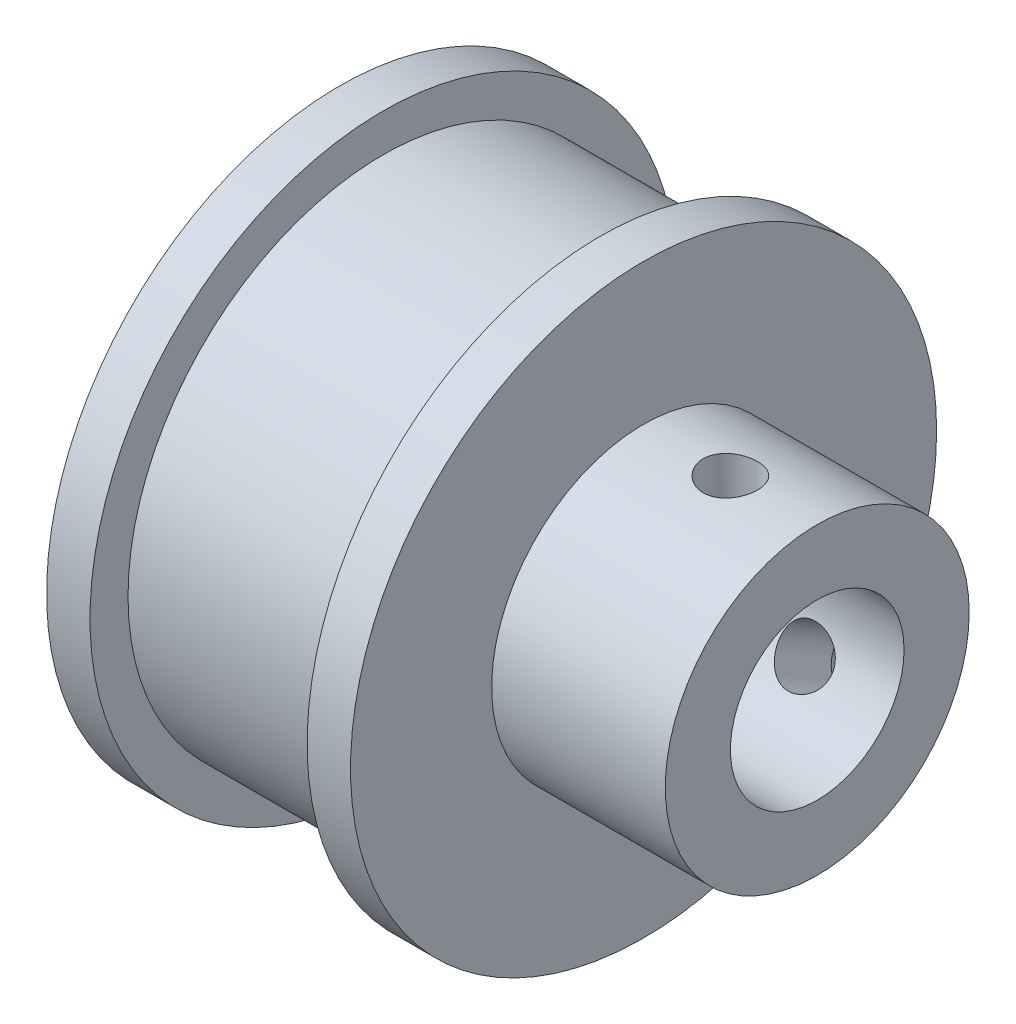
ISO-10303-21;
HEADER;
FILE_DESCRIPTION(('STEP AP214'),'2;1');
FILE_NAME('part.step','',(''),(''),'','','');
FILE_SCHEMA(('AUTOMOTIVE_DESIGN { 1 0 10303 214 1 1 1 1 }'));
ENDSEC;
DATA;
#1=APPLICATION_CONTEXT('core data for automotive mechanical design processes');
#2=APPLICATION_PROTOCOL_DEFINITION('international standard','automotive_design',2000,#1);
#3=PRODUCT_CONTEXT('',#1,'mechanical');
#4=PRODUCT('Part','Part','',(#3));
#5=PRODUCT_RELATED_PRODUCT_CATEGORY('part','',(#4));
#6=PRODUCT_DEFINITION_FORMATION('','',#4);
#7=PRODUCT_DEFINITION_CONTEXT('part definition',#1,'design');
#8=PRODUCT_DEFINITION('design','',#6,#7);
#9=PRODUCT_DEFINITION_SHAPE('','',#8);
#10=(LENGTH_UNIT() NAMED_UNIT(*) SI_UNIT(.MILLI.,.METRE.));
#11=(NAMED_UNIT(*) PLANE_ANGLE_UNIT() SI_UNIT($,.RADIAN.));
#12=(NAMED_UNIT(*) SI_UNIT($,.STERADIAN.) SOLID_ANGLE_UNIT());
#13=UNCERTAINTY_MEASURE_WITH_UNIT(LENGTH_MEASURE(1.E-05),#10,'distance_accuracy_value','');
#14=(GEOMETRIC_REPRESENTATION_CONTEXT(3) GLOBAL_UNCERTAINTY_ASSIGNED_CONTEXT((#13)) GLOBAL_UNIT_ASSIGNED_CONTEXT((#10,
#11,#12)) REPRESENTATION_CONTEXT('',''));
#15=CARTESIAN_POINT('',(0.,0.,0.));
#16=DIRECTION('',(0.,0.,1.));
#17=DIRECTION('',(1.,0.,0.));
#18=AXIS2_PLACEMENT_3D('',#15,#16,#17);
#19=CARTESIAN_POINT('',(14.,0.,0.));
#20=DIRECTION('',(1.,0.,0.));
#21=DIRECTION('',(0.,0.,-1.));
#22=AXIS2_PLACEMENT_3D('',#19,#20,#21);
#23=CYLINDRICAL_SURFACE('',#22,7.);
#24=CARTESIAN_POINT('',(18.,6.88748865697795,-1.25));
#25=CARTESIAN_POINT('',(18.0696098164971,6.88748996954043,-1.24999727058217));
#26=CARTESIAN_POINT('',(18.1392557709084,6.88855539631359,-1.24416565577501));
#27=CARTESIAN_POINT('',(18.2765881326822,6.89269731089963,-1.22100652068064));
#28=CARTESIAN_POINT('',(18.3442727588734,6.89577557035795,-1.20366887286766));
#29=CARTESIAN_POINT('',(18.4756753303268,6.90358364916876,-1.15804345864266));
#30=CARTESIAN_POINT('',(18.5393967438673,6.90831199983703,-1.12976542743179));
#31=CARTESIAN_POINT('',(18.6611855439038,6.91888575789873,-1.06308709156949));
#32=CARTESIAN_POINT('',(18.7192534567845,6.92473106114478,-1.024687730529));
#33=CARTESIAN_POINT('',(18.8287484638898,6.93695388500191,-0.938394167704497));
#34=CARTESIAN_POINT('',(18.8801024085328,6.94333619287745,-0.890407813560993));
#35=CARTESIAN_POINT('',(18.9740752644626,6.95587151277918,-0.786501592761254));
#36=CARTESIAN_POINT('',(19.0166936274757,6.96202451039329,-0.730581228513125));
#37=CARTESIAN_POINT('',(19.0922633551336,6.97345895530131,-0.611916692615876));
#38=CARTESIAN_POINT('',(19.1251461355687,6.97873410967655,-0.549128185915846));
#39=CARTESIAN_POINT('',(19.1798698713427,6.98776505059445,-0.418808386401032));
#40=CARTESIAN_POINT('',(19.2017116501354,6.99152095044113,-0.351277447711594));
#41=CARTESIAN_POINT('',(19.2335082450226,6.99705638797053,-0.214146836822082));
#42=CARTESIAN_POINT('',(19.2435862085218,6.99885638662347,-0.144576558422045));
#43=CARTESIAN_POINT('',(19.2519524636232,7.00034763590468,-0.00471086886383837));
#44=CARTESIAN_POINT('',(19.2502416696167,7.00003905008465,0.0655844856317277));
#45=CARTESIAN_POINT('',(19.2351741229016,6.99736398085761,0.20406149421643));
#46=CARTESIAN_POINT('',(19.2219499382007,6.99502092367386,0.272258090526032));
#47=CARTESIAN_POINT('',(19.1844402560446,6.98856637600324,0.405448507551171));
#48=CARTESIAN_POINT('',(19.1601543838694,6.98445482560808,0.470442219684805));
#49=CARTESIAN_POINT('',(19.1010820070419,6.97488577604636,0.595770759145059));
#50=CARTESIAN_POINT('',(19.0662417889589,6.96942141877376,0.656079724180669));
#51=CARTESIAN_POINT('',(18.9870891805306,6.95775231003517,0.770045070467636));
#52=CARTESIAN_POINT('',(18.9427759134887,6.95154749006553,0.823700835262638));
#53=CARTESIAN_POINT('',(18.8452024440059,6.93898404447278,0.923621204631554));
#54=CARTESIAN_POINT('',(18.7918263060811,6.93262448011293,0.969772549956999));
#55=CARTESIAN_POINT('',(18.6780303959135,6.92055128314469,1.052483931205));
#56=CARTESIAN_POINT('',(18.6176105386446,6.9148376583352,1.08904385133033));
#57=CARTESIAN_POINT('',(18.4913004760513,6.9047022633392,1.15156239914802));
#58=CARTESIAN_POINT('',(18.4254025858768,6.90028234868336,1.17750582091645));
#59=CARTESIAN_POINT('',(18.2900870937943,6.89326416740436,1.21792201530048));
#60=CARTESIAN_POINT('',(18.2206698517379,6.89066571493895,1.23239595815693));
#61=CARTESIAN_POINT('',(18.0813039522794,6.88762108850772,1.24929958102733));
#62=CARTESIAN_POINT('',(18.011375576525,6.88714593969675,1.25189141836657));
#63=CARTESIAN_POINT('',(17.8720848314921,6.88832434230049,1.24539080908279));
#64=CARTESIAN_POINT('',(17.802722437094,6.8899777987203,1.23629888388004));
#65=CARTESIAN_POINT('',(17.6670577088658,6.89520021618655,1.20682762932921));
#66=CARTESIAN_POINT('',(17.6007365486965,6.89875493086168,1.18653221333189));
#67=CARTESIAN_POINT('',(17.472436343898,6.90736720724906,1.13531866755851));
#68=CARTESIAN_POINT('',(17.4104575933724,6.91242487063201,1.10439981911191));
#69=CARTESIAN_POINT('',(17.2918839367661,6.92353975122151,1.03243967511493));
#70=CARTESIAN_POINT('',(17.2353525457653,6.92960692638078,0.991295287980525));
#71=CARTESIAN_POINT('',(17.1299378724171,6.94202871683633,0.900192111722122));
#72=CARTESIAN_POINT('',(17.0810552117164,6.948383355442,0.850232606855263));
#73=CARTESIAN_POINT('',(16.9917258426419,6.96075653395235,0.74219567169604));
#74=CARTESIAN_POINT('',(16.9513877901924,6.96677010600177,0.684027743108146));
#75=CARTESIAN_POINT('',(16.881056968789,6.97770176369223,0.56164648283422));
#76=CARTESIAN_POINT('',(16.8510638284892,6.98261988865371,0.497433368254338));
#77=CARTESIAN_POINT('',(16.8024397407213,6.99078504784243,0.365094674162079));
#78=CARTESIAN_POINT('',(16.7837538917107,6.99404014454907,0.296989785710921));
#79=CARTESIAN_POINT('',(16.75809885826,6.99854674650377,0.158545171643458));
#80=CARTESIAN_POINT('',(16.7511285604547,6.9997984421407,0.0882056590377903));
#81=CARTESIAN_POINT('',(16.7491382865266,7.00015390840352,-0.051666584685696));
#82=CARTESIAN_POINT('',(16.753953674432,6.99928727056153,-0.121196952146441));
#83=CARTESIAN_POINT('',(16.7750394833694,6.99556445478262,-0.258441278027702));
#84=CARTESIAN_POINT('',(16.791309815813,6.99270829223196,-0.326155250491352));
#85=CARTESIAN_POINT('',(16.8347769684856,6.98532676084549,-0.457768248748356));
#86=CARTESIAN_POINT('',(16.8619578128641,6.98080383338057,-0.521672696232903));
#87=CARTESIAN_POINT('',(16.926455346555,6.97058019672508,-0.644038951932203));
#88=CARTESIAN_POINT('',(16.9637726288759,6.96487941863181,-0.702500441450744));
#89=CARTESIAN_POINT('',(17.0480579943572,6.952836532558,-0.813145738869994));
#90=CARTESIAN_POINT('',(17.0951457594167,6.94648702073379,-0.865237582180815));
#91=CARTESIAN_POINT('',(17.1973856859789,6.9339109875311,-0.960837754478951));
#92=CARTESIAN_POINT('',(17.2525397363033,6.92768449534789,-1.0043440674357));
#93=CARTESIAN_POINT('',(17.3698905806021,6.91600352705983,-1.08187311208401));
#94=CARTESIAN_POINT('',(17.4321418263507,6.9105558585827,-1.1158144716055));
#95=CARTESIAN_POINT('',(17.5615375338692,6.90113054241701,-1.17270443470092));
#96=CARTESIAN_POINT('',(17.6286771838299,6.89715147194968,-1.19566368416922));
#97=CARTESIAN_POINT('',(17.7467033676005,6.89196709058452,-1.22512899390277));
#98=CARTESIAN_POINT('',(17.7968879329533,6.89029736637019,-1.23444009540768));
#99=CARTESIAN_POINT('',(17.8980418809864,6.88805768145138,-1.24687652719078));
#100=CARTESIAN_POINT('',(17.9490112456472,6.88748769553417,-1.25000199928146));
#101=CARTESIAN_POINT('',(18.,6.88748865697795,-1.25));
#102=B_SPLINE_CURVE_WITH_KNOTS('',3,(#24,#25,#26,#27,#28,#29,#30,#31,#32,#33,#34,#35,#36,#37,
#38,#39,#40,#41,#42,#43,#44,#45,#46,#47,#48,#49,#50,#51,#52,#53,#54,#55,#56,#57,#58,#59,#60,#61,
#62,#63,#64,#65,#66,#67,#68,#69,#70,#71,#72,#73,#74,#75,#76,#77,#78,#79,#80,#81,#82,#83,#84,#85,
#86,#87,#88,#89,#90,#91,#92,#93,#94,#95,#96,#97,#98,#99,#100,#101),.UNSPECIFIED.,.T.,.F.,(4,2,2,
2,2,2,2,2,2,2,2,2,2,2,2,2,2,2,2,2,2,2,2,2,2,2,2,2,2,2,2,2,2,2,2,2,2,2,4),(0.,0.208642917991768,
0.41746972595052,0.626111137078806,0.834733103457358,1.04546625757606,1.25621263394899,
1.46841013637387,1.68059181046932,1.89053179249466,2.10045549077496,2.30799357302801,
2.51553868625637,2.72415831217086,2.93279725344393,3.14433992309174,3.35588514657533,
3.56773231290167,3.77955786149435,3.98848380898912,4.19740043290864,4.40477310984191,
4.61215981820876,4.82172878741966,5.03131478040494,5.24342420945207,5.45552602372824,
5.66658955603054,5.87763302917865,6.08574527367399,6.29385590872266,6.50166292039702,
6.70948209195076,6.9200155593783,7.1305984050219,7.34292209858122,7.55503954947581,
7.70787268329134,7.86070231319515),.UNSPECIFIED.);
#103=CARTESIAN_POINT('',(18.,6.88748865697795,-1.25));
#104=VERTEX_POINT('',#103);
#105=EDGE_CURVE('E66',#104,#104,#102,.T.);
#106=ORIENTED_EDGE('',*,*,#105,.T.);
#107=EDGE_LOOP('',(#106));
#108=FACE_BOUND('',#107,.T.);
#109=CARTESIAN_POINT('',(14.,0.,0.));
#110=DIRECTION('',(1.,0.,0.));
#111=DIRECTION('',(0.,0.,-1.));
#112=AXIS2_PLACEMENT_3D('',#109,#110,#111);
#113=CIRCLE('',#112,7.);
#114=CARTESIAN_POINT('',(14.,0.,-7.));
#115=VERTEX_POINT('',#114);
#116=EDGE_CURVE('E60',#115,#115,#113,.T.);
#117=ORIENTED_EDGE('',*,*,#116,.T.);
#118=EDGE_LOOP('',(#117));
#119=FACE_BOUND('',#118,.T.);
#120=CARTESIAN_POINT('',(22.,0.,0.));
#121=DIRECTION('',(1.,0.,0.));
#122=DIRECTION('',(0.,0.,-1.));
#123=AXIS2_PLACEMENT_3D('',#120,#121,#122);
#124=CIRCLE('',#123,7.);
#125=CARTESIAN_POINT('',(22.,0.,-7.));
#126=VERTEX_POINT('',#125);
#127=EDGE_CURVE('E124',#126,#126,#124,.T.);
#128=ORIENTED_EDGE('',*,*,#127,.F.);
#129=EDGE_LOOP('',(#128));
#130=FACE_BOUND('',#129,.T.);
#131=CARTESIAN_POINT('',(18.,-4.52627608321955,-5.33974014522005));
#132=CARTESIAN_POINT('',(18.0696098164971,-4.52627437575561,-5.33974264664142));
#133=CARTESIAN_POINT('',(18.1392557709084,-4.5217567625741,-5.34358114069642));
#134=CARTESIAN_POINT('',(18.2765881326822,-4.50377132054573,-5.35874771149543));
#135=CARTESIAN_POINT('',(18.3442727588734,-4.49029560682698,-5.37008238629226));
#136=CARTESIAN_POINT('',(18.4756753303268,-4.45468687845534,-5.39965708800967));
#137=CARTESIAN_POINT('',(18.5393967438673,-4.43256156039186,-5.41789097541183));
#138=CARTESIAN_POINT('',(18.6611855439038,-4.38010330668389,-5.46038728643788));
#139=CARTESIAN_POINT('',(18.7192534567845,-4.34977113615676,-5.48464914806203));
#140=CARTESIAN_POINT('',(18.8287484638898,-4.28115013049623,-5.53838120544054));
#141=CARTESIAN_POINT('',(18.8801024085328,-4.24278388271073,-5.56790162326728));
#142=CARTESIAN_POINT('',(18.9740752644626,-4.15906611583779,-5.63071063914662));
#143=CARTESIAN_POINT('',(19.0166936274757,-4.11371415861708,-5.66399947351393));
#144=CARTESIAN_POINT('',(19.0922633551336,-4.01666487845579,-5.73323426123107));
#145=CARTESIAN_POINT('',(19.1251461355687,-3.96492601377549,-5.76919693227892));
#146=CARTESIAN_POINT('',(19.1798698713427,-3.85658122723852,-5.84217785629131));
#147=CARTESIAN_POINT('',(19.2017116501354,-3.79997566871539,-5.87919603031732));
#148=CARTESIAN_POINT('',(19.2335082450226,-3.6839847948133,-5.95255516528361));
#149=CARTESIAN_POINT('',(19.2435862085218,-3.62463516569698,-5.98889914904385));
#150=CARTESIAN_POINT('',(19.2519524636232,-3.50425355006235,-6.06012345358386));
#151=CARTESIAN_POINT('',(19.2502416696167,-3.44322169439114,-6.09500388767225));
#152=CARTESIAN_POINT('',(19.2351741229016,-3.3219595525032,-6.1619257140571));
#153=CARTESIAN_POINT('',(19.2219499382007,-3.26172803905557,-6.19399486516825));
#154=CARTESIAN_POINT('',(19.1844402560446,-3.14315448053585,-6.25500027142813));
#155=CARTESIAN_POINT('',(19.1601543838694,-3.08481249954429,-6.2839364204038));
#156=CARTESIAN_POINT('',(19.1010820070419,-2.97149027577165,-6.3383136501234));
#157=CARTESIAN_POINT('',(19.0662417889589,-2.91652900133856,-6.36373586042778));
#158=CARTESIAN_POINT('',(18.9870891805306,-2.81199756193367,-6.41061278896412));
#159=CARTESIAN_POINT('',(18.9427759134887,-2.76242789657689,-6.43206713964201));
#160=CARTESIAN_POINT('',(18.8452024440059,-2.66961259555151,-6.47114706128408));
#161=CARTESIAN_POINT('',(18.7918263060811,-2.62646457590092,-6.48871518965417));
#162=CARTESIAN_POINT('',(18.6780303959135,-2.54879782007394,-6.51961518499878));
#163=CARTESIAN_POINT('',(18.6176105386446,-2.51427918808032,-6.53294700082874));
#164=CARTESIAN_POINT('',(18.4913004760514,-2.45506883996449,-6.55542876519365));
#165=CARTESIAN_POINT('',(18.4254025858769,-2.43039122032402,-6.56457271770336));
#166=CARTESIAN_POINT('',(18.2900870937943,-2.39188067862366,-6.5787028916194));
#167=CARTESIAN_POINT('',(18.2206698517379,-2.37804665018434,-6.58368953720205));
#168=CARTESIAN_POINT('',(18.0813039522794,-2.36188537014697,-6.58950462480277));
#169=CARTESIAN_POINT('',(18.011375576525,-2.35940319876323,-6.59038905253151));
#170=CARTESIAN_POINT('',(17.8720848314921,-2.36562209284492,-6.58815927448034));
#171=CARTESIAN_POINT('',(17.802722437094,-2.37432265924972,-6.58504524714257));
#172=CARTESIAN_POINT('',(17.6670577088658,-2.40245672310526,-6.5748323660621));
#173=CARTESIAN_POINT('',(17.6007365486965,-2.42181042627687,-6.56776313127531));
#174=CARTESIAN_POINT('',(17.472436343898,-2.47046879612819,-6.5496148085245));
#175=CARTESIAN_POINT('',(17.4104575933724,-2.49977413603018,-6.53853544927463));
#176=CARTESIAN_POINT('',(17.2918839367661,-2.56765088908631,-6.51218114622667));
#177=CARTESIAN_POINT('',(17.2353525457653,-2.60631656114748,-6.49686328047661));
#178=CARTESIAN_POINT('',(17.1299378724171,-2.69142512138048,-6.4620692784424));
#179=CARTESIAN_POINT('',(17.0810552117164,-2.7378686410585,-6.44259280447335));
#180=CARTESIAN_POINT('',(16.9917258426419,-2.83761796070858,-6.39928982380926));
#181=CARTESIAN_POINT('',(16.9513877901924,-2.89099965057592,-6.3754137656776));
#182=CARTESIAN_POINT('',(16.881056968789,-3.00245075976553,-6.32369022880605));
#183=CARTESIAN_POINT('',(16.8510638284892,-3.06052001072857,-6.29584289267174));
#184=CARTESIAN_POINT('',(16.8024397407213,-3.17921126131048,-6.23674478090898));
#185=CARTESIAN_POINT('',(16.7837538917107,-3.23981937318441,-6.20551133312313));
#186=CARTESIAN_POINT('',(16.75809885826,-3.36196922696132,-6.14019185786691));
#187=CARTESIAN_POINT('',(16.7511285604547,-3.4235108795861,-6.10610610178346));
#188=CARTESIAN_POINT('',(16.7491382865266,-3.54482152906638,-6.03647782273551));
#189=CARTESIAN_POINT('',(16.753953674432,-3.60460327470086,-6.0009621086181));
#190=CARTESIAN_POINT('',(16.7750394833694,-3.72159893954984,-5.92911589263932));
#191=CARTESIAN_POINT('',(16.791309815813,-3.77881287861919,-5.89278539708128));
#192=CARTESIAN_POINT('',(16.8347769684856,-3.88910231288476,-5.82058630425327));
#193=CARTESIAN_POINT('',(16.8619578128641,-3.94218372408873,-5.78471711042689));
#194=CARTESIAN_POINT('',(16.926455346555,-4.04304419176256,-5.71468005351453));
#195=CARTESIAN_POINT('',(16.9637726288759,-4.09082293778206,-5.68051229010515));
#196=CARTESIAN_POINT('',(17.0480579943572,-4.18062313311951,-5.61476019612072));
#197=CARTESIAN_POINT('',(17.0951457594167,-4.22256123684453,-5.58321543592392));
#198=CARTESIAN_POINT('',(17.1973856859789,-4.29906539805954,-5.52452418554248));
#199=CARTESIAN_POINT('',(17.2525397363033,-4.33362972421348,-5.49737872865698));
#200=CARTESIAN_POINT('',(17.3698905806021,-4.39493136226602,-5.44849819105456));
#201=CARTESIAN_POINT('',(17.4321418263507,-4.42160160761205,-5.42680969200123));
#202=CARTESIAN_POINT('',(17.5615375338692,-4.4661571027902,-5.39020214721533));
#203=CARTESIAN_POINT('',(17.6286771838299,-4.4840508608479,-5.37527654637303));
#204=CARTESIAN_POINT('',(17.7467033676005,-4.50697637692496,-5.35605408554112));
#205=CARTESIAN_POINT('',(17.7968879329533,-4.51420516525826,-5.34995251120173));
#206=CARTESIAN_POINT('',(17.8980418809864,-4.52385558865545,-5.34179467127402));
#207=CARTESIAN_POINT('',(17.9490112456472,-4.52627733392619,-5.33973831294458));
#208=CARTESIAN_POINT('',(18.,-4.52627608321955,-5.33974014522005));
#209=B_SPLINE_CURVE_WITH_KNOTS('',3,(#131,#132,#133,#134,#135,#136,#137,#138,#139,#140,#141,
#142,#143,#144,#145,#146,#147,#148,#149,#150,#151,#152,#153,#154,#155,#156,#157,#158,#159,#160,
#161,#162,#163,#164,#165,#166,#167,#168,#169,#170,#171,#172,#173,#174,#175,#176,#177,#178,#179,
#180,#181,#182,#183,#184,#185,#186,#187,#188,#189,#190,#191,#192,#193,#194,#195,#196,#197,#198,
#199,#200,#201,#202,#203,#204,#205,#206,#207,#208),.UNSPECIFIED.,.T.,.F.,(4,2,2,2,2,2,2,2,2,2,2,
2,2,2,2,2,2,2,2,2,2,2,2,2,2,2,2,2,2,2,2,2,2,2,2,2,2,2,4),(0.,0.208642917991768,0.41746972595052,
0.626111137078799,0.834733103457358,1.04546625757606,1.25621263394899,1.46841013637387,
1.68059181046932,1.89053179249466,2.10045549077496,2.30799357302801,2.51553868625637,
2.72415831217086,2.93279725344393,3.14433992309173,3.35588514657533,3.56773231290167,
3.77955786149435,3.98848380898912,4.19740043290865,4.40477310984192,4.61215981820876,
4.82172878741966,5.03131478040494,5.24342420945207,5.45552602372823,5.66658955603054,
5.87763302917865,6.08574527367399,6.29385590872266,6.50166292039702,6.70948209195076,
6.9200155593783,7.1305984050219,7.34292209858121,7.55503954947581,7.70787268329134,
7.86070231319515),.UNSPECIFIED.);
#210=CARTESIAN_POINT('',(18.,-4.52627608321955,-5.33974014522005));
#211=VERTEX_POINT('',#210);
#212=EDGE_CURVE('E67',#211,#211,#209,.T.);
#213=ORIENTED_EDGE('',*,*,#212,.T.);
#214=EDGE_LOOP('',(#213));
#215=FACE_BOUND('',#214,.T.);
#216=ADVANCED_FACE('F32',(#108,#119,#130,#215),#23,.T.);
#217=CARTESIAN_POINT('',(0.,0.,0.));
#218=DIRECTION('',(1.,0.,0.));
#219=DIRECTION('',(0.,0.,-1.));
#220=AXIS2_PLACEMENT_3D('',#217,#218,#219);
#221=CYLINDRICAL_SURFACE('',#220,4.);
#222=CARTESIAN_POINT('',(18.,3.79967103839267,-1.25));
#223=CARTESIAN_POINT('',(18.0683470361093,3.79967145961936,-1.24999953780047));
#224=CARTESIAN_POINT('',(18.1366987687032,3.80153531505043,-1.24437538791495));
#225=CARTESIAN_POINT('',(18.2713941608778,3.80875638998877,-1.22209175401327));
#226=CARTESIAN_POINT('',(18.3377372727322,3.81411455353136,-1.20542928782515));
#227=CARTESIAN_POINT('',(18.466444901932,3.8276593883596,-1.16169788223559));
#228=CARTESIAN_POINT('',(18.5288162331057,3.83584105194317,-1.13464735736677));
#229=CARTESIAN_POINT('',(18.648152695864,3.85410406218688,-1.07096914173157));
#230=CARTESIAN_POINT('',(18.7051168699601,3.8641857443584,-1.03433975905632));
#231=CARTESIAN_POINT('',(18.8139788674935,3.8855012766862,-0.951196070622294));
#232=CARTESIAN_POINT('',(18.865663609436,3.8967612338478,-0.904409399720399));
#233=CARTESIAN_POINT('',(18.9605960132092,3.91894245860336,-0.802862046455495));
#234=CARTESIAN_POINT('',(19.0038424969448,3.92986367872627,-0.748100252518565));
#235=CARTESIAN_POINT('',(19.0816110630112,3.95043553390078,-0.630625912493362));
#236=CARTESIAN_POINT('',(19.1159137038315,3.9600518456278,-0.567761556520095));
#237=CARTESIAN_POINT('',(19.1733760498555,3.97662551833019,-0.436804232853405));
#238=CARTESIAN_POINT('',(19.1965383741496,3.98358350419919,-0.368712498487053));
#239=CARTESIAN_POINT('',(19.2303511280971,3.99387175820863,-0.231464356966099));
#240=CARTESIAN_POINT('',(19.2413657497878,3.99730738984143,-0.162405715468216));
#241=CARTESIAN_POINT('',(19.2517243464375,4.00053595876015,-0.0233408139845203));
#242=CARTESIAN_POINT('',(19.2510709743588,4.00032972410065,0.0466652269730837));
#243=CARTESIAN_POINT('',(19.2383517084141,3.99637116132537,0.183074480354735));
#244=CARTESIAN_POINT('',(19.226680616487,3.99274150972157,0.249518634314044));
#245=CARTESIAN_POINT('',(19.192905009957,3.98249482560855,0.37945306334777));
#246=CARTESIAN_POINT('',(19.1707998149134,3.97587759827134,0.442943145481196));
#247=CARTESIAN_POINT('',(19.1165298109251,3.96023459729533,0.566078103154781));
#248=CARTESIAN_POINT('',(19.084245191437,3.95118033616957,0.62566640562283));
#249=CARTESIAN_POINT('',(19.0106289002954,3.93161722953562,0.738702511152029));
#250=CARTESIAN_POINT('',(18.9692949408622,3.92110801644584,0.792148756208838));
#251=CARTESIAN_POINT('',(18.8767263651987,3.89923670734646,0.893737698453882));
#252=CARTESIAN_POINT('',(18.8251509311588,3.88785731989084,0.941566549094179));
#253=CARTESIAN_POINT('',(18.7146048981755,3.86590615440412,1.02798974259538));
#254=CARTESIAN_POINT('',(18.655633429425,3.85533447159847,1.06658299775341));
#255=CARTESIAN_POINT('',(18.5310825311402,3.83610846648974,1.13380465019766));
#256=CARTESIAN_POINT('',(18.4654365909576,3.82747690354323,1.16231680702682));
#257=CARTESIAN_POINT('',(18.3299405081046,3.81337545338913,1.20778345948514));
#258=CARTESIAN_POINT('',(18.2600918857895,3.80790443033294,1.22474210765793));
#259=CARTESIAN_POINT('',(18.1211800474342,3.80099563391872,1.24601485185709));
#260=CARTESIAN_POINT('',(18.0521980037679,3.79940466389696,1.25080954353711));
#261=CARTESIAN_POINT('',(17.9144102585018,3.80001077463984,1.24896744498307));
#262=CARTESIAN_POINT('',(17.8456045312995,3.80220727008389,1.24233242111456));
#263=CARTESIAN_POINT('',(17.7121917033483,3.80998957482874,1.21824873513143));
#264=CARTESIAN_POINT('',(17.647520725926,3.81547554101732,1.20111831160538));
#265=CARTESIAN_POINT('',(17.521978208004,3.82911287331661,1.15690373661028));
#266=CARTESIAN_POINT('',(17.4611072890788,3.83726467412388,1.12981796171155));
#267=CARTESIAN_POINT('',(17.3429608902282,3.85560539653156,1.06557510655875));
#268=CARTESIAN_POINT('',(17.2858385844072,3.86584603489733,1.02815147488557));
#269=CARTESIAN_POINT('',(17.1785096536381,3.88710348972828,0.944606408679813));
#270=CARTESIAN_POINT('',(17.1283048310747,3.89812050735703,0.898482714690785));
#271=CARTESIAN_POINT('',(17.0340896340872,3.92024187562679,0.796572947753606));
#272=CARTESIAN_POINT('',(16.9904222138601,3.93133092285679,0.740465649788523));
#273=CARTESIAN_POINT('',(16.9131089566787,3.95189059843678,0.6214515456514));
#274=CARTESIAN_POINT('',(16.879462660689,3.96136130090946,0.558545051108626));
#275=CARTESIAN_POINT('',(16.8234694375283,3.97756311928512,0.428105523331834));
#276=CARTESIAN_POINT('',(16.8010407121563,3.984313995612,0.360610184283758));
#277=CARTESIAN_POINT('',(16.7679274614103,3.99440242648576,0.222557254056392));
#278=CARTESIAN_POINT('',(16.7572392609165,3.99774104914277,0.152000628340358));
#279=CARTESIAN_POINT('',(16.7482089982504,4.00055803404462,0.0129849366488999));
#280=CARTESIAN_POINT('',(16.7493715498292,4.0001912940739,-0.0554391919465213));
#281=CARTESIAN_POINT('',(16.7628118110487,3.99600978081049,-0.191073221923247));
#282=CARTESIAN_POINT('',(16.7750887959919,3.99219523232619,-0.258283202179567));
#283=CARTESIAN_POINT('',(16.8100940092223,3.98159570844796,-0.38875511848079));
#284=CARTESIAN_POINT('',(16.8326896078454,3.97484847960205,-0.452055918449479));
#285=CARTESIAN_POINT('',(16.8875708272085,3.9590794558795,-0.57399842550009));
#286=CARTESIAN_POINT('',(16.9198581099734,3.95005727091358,-0.632639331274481));
#287=CARTESIAN_POINT('',(16.9944727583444,3.93029896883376,-0.74576169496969));
#288=CARTESIAN_POINT('',(17.037103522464,3.91951509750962,-0.800034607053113));
#289=CARTESIAN_POINT('',(17.1306598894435,3.89758736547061,-0.90082079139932));
#290=CARTESIAN_POINT('',(17.1815879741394,3.88644339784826,-0.94733173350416));
#291=CARTESIAN_POINT('',(17.2923157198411,3.86461892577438,-1.03282865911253));
#292=CARTESIAN_POINT('',(17.3523534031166,3.85396600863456,-1.07151427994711));
#293=CARTESIAN_POINT('',(17.4783981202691,3.83480125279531,-1.13820470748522));
#294=CARTESIAN_POINT('',(17.5444027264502,3.82628854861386,-1.16621383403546));
#295=CARTESIAN_POINT('',(17.6747226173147,3.81306560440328,-1.20871180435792));
#296=CARTESIAN_POINT('',(17.7387025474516,3.80809315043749,-1.22414939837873));
#297=CARTESIAN_POINT('',(17.8684538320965,3.80139606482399,-1.244792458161));
#298=CARTESIAN_POINT('',(17.9342247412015,3.79967063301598,-1.25000044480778));
#299=CARTESIAN_POINT('',(18.,3.79967103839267,-1.25));
#300=B_SPLINE_CURVE_WITH_KNOTS('',3,(#222,#223,#224,#225,#226,#227,#228,#229,#230,#231,#232,
#233,#234,#235,#236,#237,#238,#239,#240,#241,#242,#243,#244,#245,#246,#247,#248,#249,#250,#251,
#252,#253,#254,#255,#256,#257,#258,#259,#260,#261,#262,#263,#264,#265,#266,#267,#268,#269,#270,
#271,#272,#273,#274,#275,#276,#277,#278,#279,#280,#281,#282,#283,#284,#285,#286,#287,#288,#289,
#290,#291,#292,#293,#294,#295,#296,#297,#298,#299),.UNSPECIFIED.,.T.,.F.,(4,2,2,2,2,2,2,2,2,2,2,
2,2,2,2,2,2,2,2,2,2,2,2,2,2,2,2,2,2,2,2,2,2,2,2,2,2,2,4),(0.,0.20479813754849,0.409651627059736,
0.614143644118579,0.818671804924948,1.02957080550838,1.24049922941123,1.45619821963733,
1.67184647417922,1.88083722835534,2.08978046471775,2.29150982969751,2.49325235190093,
2.69746404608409,2.90172742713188,3.11450338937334,3.32730439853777,3.54248470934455,
3.75758763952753,3.96404933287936,4.1704791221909,4.37093972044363,4.5714330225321,
4.77767613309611,4.98397288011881,5.19881937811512,5.41365603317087,5.62690239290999,
5.84008198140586,6.04438802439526,6.24868074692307,6.4504184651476,6.65219079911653,
6.86080693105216,7.06948557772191,7.28507795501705,7.50058300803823,7.69772354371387,
7.8948154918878),.UNSPECIFIED.);
#301=CARTESIAN_POINT('',(18.,3.79967103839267,-1.25));
#302=VERTEX_POINT('',#301);
#303=EDGE_CURVE('E61',#302,#302,#300,.T.);
#304=ORIENTED_EDGE('',*,*,#303,.F.);
#305=EDGE_LOOP('',(#304));
#306=FACE_BOUND('',#305,.T.);
#307=CARTESIAN_POINT('',(0.,0.,0.));
#308=DIRECTION('',(1.,0.,0.));
#309=DIRECTION('',(0.,0.,-1.));
#310=AXIS2_PLACEMENT_3D('',#307,#308,#309);
#311=CIRCLE('',#310,4.);
#312=CARTESIAN_POINT('',(0.,0.,-4.));
#313=VERTEX_POINT('',#312);
#314=EDGE_CURVE('E88',#313,#313,#311,.T.);
#315=ORIENTED_EDGE('',*,*,#314,.F.);
#316=EDGE_LOOP('',(#315));
#317=FACE_BOUND('',#316,.T.);
#318=CARTESIAN_POINT('',(22.,0.,0.));
#319=DIRECTION('',(1.,0.,0.));
#320=DIRECTION('',(0.,0.,-1.));
#321=AXIS2_PLACEMENT_3D('',#318,#319,#320);
#322=CIRCLE('',#321,4.);
#323=CARTESIAN_POINT('',(22.,0.,-4.));
#324=VERTEX_POINT('',#323);
#325=EDGE_CURVE('E85',#324,#324,#322,.T.);
#326=ORIENTED_EDGE('',*,*,#325,.T.);
#327=EDGE_LOOP('',(#326));
#328=FACE_BOUND('',#327,.T.);
#329=CARTESIAN_POINT('',(18.,-2.98236727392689,-2.66561164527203));
#330=CARTESIAN_POINT('',(18.0683470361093,-2.98236708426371,-2.66561224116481));
#331=CARTESIAN_POINT('',(18.1366987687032,-2.97842835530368,-2.67003846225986));
#332=CARTESIAN_POINT('',(18.2713941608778,-2.96274069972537,-2.68743391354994));
#333=CARTESIAN_POINT('',(18.3377372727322,-2.95098966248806,-2.70040545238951));
#334=CARTESIAN_POINT('',(18.466444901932,-2.91988957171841,-2.73400132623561));
#335=CARTESIAN_POINT('',(18.5288162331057,-2.9005539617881,-2.75461211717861));
#336=CARTESIAN_POINT('',(18.648152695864,-2.85453851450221,-2.80226745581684));
#337=CARTESIAN_POINT('',(18.7051168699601,-2.82785737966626,-2.82931314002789));
#338=CARTESIAN_POINT('',(18.8139788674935,-2.76651059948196,-2.88934477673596));
#339=CARTESIAN_POINT('',(18.865663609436,-2.73162213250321,-2.92248952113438));
#340=CARTESIAN_POINT('',(18.9605960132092,-2.65477015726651,-2.99247270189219));
#341=CARTESIAN_POINT('',(19.0038424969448,-2.61280566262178,-3.02931165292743));
#342=CARTESIAN_POINT('',(19.0816110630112,-2.5213558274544,-3.10586457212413));
#343=CARTESIAN_POINT('',(19.1159137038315,-2.47172185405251,-3.14562472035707));
#344=CARTESIAN_POINT('',(19.1733760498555,-2.36659632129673,-3.22545660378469));
#345=CARTESIAN_POINT('',(19.1965383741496,-2.31110614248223,-3.2655282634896));
#346=CARTESIAN_POINT('',(19.2303511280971,-2.1973898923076,-3.34306222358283));
#347=CARTESIAN_POINT('',(19.2413657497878,-2.13930117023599,-3.38056688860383));
#348=CARTESIAN_POINT('',(19.2517243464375,-2.02048171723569,-3.45289536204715));
#349=CARTESIAN_POINT('',(19.2510709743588,-1.95975159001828,-3.48771977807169));
#350=CARTESIAN_POINT('',(19.2383517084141,-1.83963842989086,-3.55249618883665));
#351=CARTESIAN_POINT('',(19.226680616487,-1.78028127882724,-3.58257489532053));
#352=CARTESIAN_POINT('',(19.192905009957,-1.66263142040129,-3.63866822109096));
#353=CARTESIAN_POINT('',(19.1707998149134,-1.60433878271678,-3.66468257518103));
#354=CARTESIAN_POINT('',(19.1165298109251,-1.48987928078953,-3.71270281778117));
#355=CARTESIAN_POINT('',(19.084245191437,-1.43374716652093,-3.7346557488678));
#356=CARTESIAN_POINT('',(19.0106289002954,-1.32607347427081,-3.77423165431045));
#357=CARTESIAN_POINT('',(18.9692949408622,-1.27453306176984,-3.79185353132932));
#358=CARTESIAN_POINT('',(18.8767263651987,-1.17561880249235,-3.82370689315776));
#359=CARTESIAN_POINT('',(18.8251509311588,-1.12850810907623,-3.83776647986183));
#360=CARTESIAN_POINT('',(18.7146048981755,-1.04268784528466,-3.86196780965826));
#361=CARTESIAN_POINT('',(18.655633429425,-1.00397926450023,-3.87210909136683));
#362=CARTESIAN_POINT('',(18.5310825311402,-0.936150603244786,-3.8890697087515));
#363=CARTESIAN_POINT('',(18.4654365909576,-0.907142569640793,-3.89585063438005));
#364=CARTESIAN_POINT('',(18.3299405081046,-0.860716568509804,-3.90637174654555));
#365=CARTESIAN_POINT('',(18.2600918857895,-0.84329443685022,-3.9101130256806));
#366=CARTESIAN_POINT('',(18.1211800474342,-0.821417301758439,-3.91476620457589));
#367=CARTESIAN_POINT('',(18.0521980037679,-0.816469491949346,-3.91578572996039));
#368=CARTESIAN_POINT('',(17.9144102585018,-0.818367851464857,-3.91538958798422));
#369=CARTESIAN_POINT('',(17.8456045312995,-0.825212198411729,-3.91397429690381));
#370=CARTESIAN_POINT('',(17.7121917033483,-0.849960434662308,-3.90867212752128));
#371=CARTESIAN_POINT('',(17.647520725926,-0.867538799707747,-3.90485790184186));
#372=CARTESIAN_POINT('',(17.521978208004,-0.912648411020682,-3.89456089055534));
#373=CARTESIAN_POINT('',(17.4611072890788,-0.940181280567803,-3.88807766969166));
#374=CARTESIAN_POINT('',(17.3429608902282,-1.00498758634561,-3.87183977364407));
#375=CARTESIAN_POINT('',(17.2858385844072,-1.04251772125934,-3.86199661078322));
#376=CARTESIAN_POINT('',(17.1785096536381,-1.12549859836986,-3.83863357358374));
#377=CARTESIAN_POINT('',(17.1283048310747,-1.1709513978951,-3.82511274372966));
#378=CARTESIAN_POINT('',(17.0340896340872,-1.27026852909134,-3.79331552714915));
#379=CARTESIAN_POINT('',(16.9904222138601,-1.32440339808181,-3.77486527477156));
#380=CARTESIAN_POINT('',(16.9131089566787,-1.4377524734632,-3.73316342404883));
#381=CARTESIAN_POINT('',(16.879462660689,-1.4969664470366,-3.70991204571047));
#382=CARTESIAN_POINT('',(16.8234694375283,-1.61803130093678,-3.6587234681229));
#383=CARTESIAN_POINT('',(16.8010407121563,-1.6798594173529,-3.63082222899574));
#384=CARTESIAN_POINT('',(16.7679274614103,-1.80446097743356,-3.57053260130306));
#385=CARTESIAN_POINT('',(16.7572392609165,-1.86723411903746,-3.53814562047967));
#386=CARTESIAN_POINT('',(16.7482089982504,-1.98903373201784,-3.47107735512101));
#387=CARTESIAN_POINT('',(16.7493715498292,-2.04810739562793,-3.43654768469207));
#388=CARTESIAN_POINT('',(16.7628118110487,-2.16347915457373,-3.36510937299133));
#389=CARTESIAN_POINT('',(16.7750887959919,-2.21977743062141,-3.3282008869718));
#390=CARTESIAN_POINT('',(16.8100940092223,-2.32746966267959,-3.25378547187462));
#391=CARTESIAN_POINT('',(16.8326896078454,-2.3789161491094,-3.21629180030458));
#392=CARTESIAN_POINT('',(16.8875708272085,-2.47663694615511,-3.14166417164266));
#393=CARTESIAN_POINT('',(16.9198581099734,-2.5229103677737,-3.10453027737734));
#394=CARTESIAN_POINT('',(16.9944727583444,-2.61099805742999,-3.03085790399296));
#395=CARTESIAN_POINT('',(17.037103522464,-2.65260784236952,-2.9943823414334));
#396=CARTESIAN_POINT('',(17.1306598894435,-2.72892737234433,-2.92499927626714));
#397=CARTESIAN_POINT('',(17.1815879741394,-2.7636350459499,-2.89209284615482));
#398=CARTESIAN_POINT('',(17.2923157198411,-2.82676531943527,-2.83044383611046));
#399=CARTESIAN_POINT('',(17.3523534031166,-2.85494159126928,-2.80187532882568));
#400=CARTESIAN_POINT('',(17.4783981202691,-2.9031148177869,-2.75193294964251));
#401=CARTESIAN_POINT('',(17.5444027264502,-2.9231150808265,-2.73055616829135));
#402=CARTESIAN_POINT('',(17.6747226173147,-2.95330793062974,-2.69785577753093));
#403=CARTESIAN_POINT('',(17.7387025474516,-2.96419105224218,-2.685830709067));
#404=CARTESIAN_POINT('',(17.8684538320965,-2.97871992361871,-2.66970933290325));
#405=CARTESIAN_POINT('',(17.9342247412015,-2.98236745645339,-2.66561107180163));
#406=CARTESIAN_POINT('',(18.,-2.98236727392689,-2.66561164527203));
#407=B_SPLINE_CURVE_WITH_KNOTS('',3,(#329,#330,#331,#332,#333,#334,#335,#336,#337,#338,#339,
#340,#341,#342,#343,#344,#345,#346,#347,#348,#349,#350,#351,#352,#353,#354,#355,#356,#357,#358,
#359,#360,#361,#362,#363,#364,#365,#366,#367,#368,#369,#370,#371,#372,#373,#374,#375,#376,#377,
#378,#379,#380,#381,#382,#383,#384,#385,#386,#387,#388,#389,#390,#391,#392,#393,#394,#395,#396,
#397,#398,#399,#400,#401,#402,#403,#404,#405,#406),.UNSPECIFIED.,.T.,.F.,(4,2,2,2,2,2,2,2,2,2,2,
2,2,2,2,2,2,2,2,2,2,2,2,2,2,2,2,2,2,2,2,2,2,2,2,2,2,2,4),(0.,0.20479813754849,0.409651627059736,
0.614143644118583,0.818671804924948,1.02957080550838,1.24049922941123,1.45619821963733,
1.67184647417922,1.88083722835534,2.08978046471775,2.29150982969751,2.49325235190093,
2.69746404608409,2.90172742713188,3.11450338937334,3.32730439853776,3.54248470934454,
3.75758763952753,3.96404933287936,4.1704791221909,4.37093972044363,4.5714330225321,
4.77767613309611,4.98397288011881,5.19881937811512,5.41365603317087,5.62690239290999,
5.84008198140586,6.04438802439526,6.24868074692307,6.4504184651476,6.65219079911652,
6.86080693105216,7.06948557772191,7.28507795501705,7.50058300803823,7.69772354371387,
7.8948154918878),.UNSPECIFIED.);
#408=CARTESIAN_POINT('',(18.,-2.98236727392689,-2.66561164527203));
#409=VERTEX_POINT('',#408);
#410=EDGE_CURVE('E36',#409,#409,#407,.T.);
#411=ORIENTED_EDGE('',*,*,#410,.F.);
#412=EDGE_LOOP('',(#411));
#413=FACE_BOUND('',#412,.T.);
#414=ADVANCED_FACE('F68',(#306,#317,#328,#413),#221,.F.);
#415=CARTESIAN_POINT('',(22.,0.,0.));
#416=DIRECTION('',(-1.,0.,0.));
#417=DIRECTION('',(0.,0.,1.));
#418=AXIS2_PLACEMENT_3D('',#415,#416,#417);
#419=CYLINDRICAL_SURFACE('',#418,13.5);
#420=CARTESIAN_POINT('',(12.,0.,0.));
#421=DIRECTION('',(1.,0.,0.));
#422=DIRECTION('',(0.,0.,-1.));
#423=AXIS2_PLACEMENT_3D('',#420,#421,#422);
#424=CIRCLE('',#423,13.5);
#425=CARTESIAN_POINT('',(12.,0.,-13.5));
#426=VERTEX_POINT('',#425);
#427=EDGE_CURVE('E44',#426,#426,#424,.T.);
#428=ORIENTED_EDGE('',*,*,#427,.T.);
#429=EDGE_LOOP('',(#428));
#430=FACE_BOUND('',#429,.T.);
#431=CARTESIAN_POINT('',(14.,0.,0.));
#432=DIRECTION('',(1.,0.,0.));
#433=DIRECTION('',(0.,0.,-1.));
#434=AXIS2_PLACEMENT_3D('',#431,#432,#433);
#435=CIRCLE('',#434,13.5);
#436=CARTESIAN_POINT('',(14.,0.,-13.5));
#437=VERTEX_POINT('',#436);
#438=EDGE_CURVE('E58',#437,#437,#435,.T.);
#439=ORIENTED_EDGE('',*,*,#438,.F.);
#440=EDGE_LOOP('',(#439));
#441=FACE_BOUND('',#440,.T.);
#442=ADVANCED_FACE('F34',(#430,#441),#419,.T.);
#443=CARTESIAN_POINT('',(12.,0.,0.));
#444=DIRECTION('',(1.,0.,0.));
#445=DIRECTION('',(0.,0.,-1.));
#446=AXIS2_PLACEMENT_3D('',#443,#444,#445);
#447=PLANE('',#446);
#448=CARTESIAN_POINT('',(12.,0.,0.));
#449=DIRECTION('',(1.,0.,0.));
#450=DIRECTION('',(0.,0.,-1.));
#451=AXIS2_PLACEMENT_3D('',#448,#449,#450);
#452=CIRCLE('',#451,11.75);
#453=CARTESIAN_POINT('',(12.,0.,-11.75));
#454=VERTEX_POINT('',#453);
#455=EDGE_CURVE('E56',#454,#454,#452,.T.);
#456=ORIENTED_EDGE('',*,*,#455,.T.);
#457=EDGE_LOOP('',(#456));
#458=FACE_BOUND('',#457,.T.);
#459=ORIENTED_EDGE('',*,*,#427,.F.);
#460=EDGE_LOOP('',(#459));
#461=FACE_BOUND('',#460,.T.);
#462=ADVANCED_FACE('F106',(#458,#461),#447,.F.);
#463=CARTESIAN_POINT('',(2.,0.,0.));
#464=DIRECTION('',(1.,0.,0.));
#465=DIRECTION('',(0.,0.,-1.));
#466=AXIS2_PLACEMENT_3D('',#463,#464,#465);
#467=PLANE('',#466);
#468=CARTESIAN_POINT('',(2.,0.,0.));
#469=DIRECTION('',(1.,0.,0.));
#470=DIRECTION('',(0.,0.,-1.));
#471=AXIS2_PLACEMENT_3D('',#468,#469,#470);
#472=CIRCLE('',#471,11.75);
#473=CARTESIAN_POINT('',(2.,0.,-11.75));
#474=VERTEX_POINT('',#473);
#475=EDGE_CURVE('E53',#474,#474,#472,.T.);
#476=ORIENTED_EDGE('',*,*,#475,.F.);
#477=EDGE_LOOP('',(#476));
#478=FACE_BOUND('',#477,.T.);
#479=CARTESIAN_POINT('',(2.,0.,0.));
#480=DIRECTION('',(1.,0.,0.));
#481=DIRECTION('',(0.,0.,-1.));
#482=AXIS2_PLACEMENT_3D('',#479,#480,#481);
#483=CIRCLE('',#482,13.5);
#484=CARTESIAN_POINT('',(2.,0.,-13.5));
#485=VERTEX_POINT('',#484);
#486=EDGE_CURVE('E49',#485,#485,#483,.T.);
#487=ORIENTED_EDGE('',*,*,#486,.T.);
#488=EDGE_LOOP('',(#487));
#489=FACE_BOUND('',#488,.T.);
#490=ADVANCED_FACE('F104',(#478,#489),#467,.T.);
#491=CARTESIAN_POINT('',(12.,0.,0.));
#492=DIRECTION('',(-1.,0.,0.));
#493=DIRECTION('',(0.,0.,1.));
#494=AXIS2_PLACEMENT_3D('',#491,#492,#493);
#495=CYLINDRICAL_SURFACE('',#494,11.75);
#496=ORIENTED_EDGE('',*,*,#455,.F.);
#497=EDGE_LOOP('',(#496));
#498=FACE_BOUND('',#497,.T.);
#499=ORIENTED_EDGE('',*,*,#475,.T.);
#500=EDGE_LOOP('',(#499));
#501=FACE_BOUND('',#500,.T.);
#502=ADVANCED_FACE('F100',(#498,#501),#495,.T.);
#503=CARTESIAN_POINT('',(0.,0.,0.));
#504=DIRECTION('',(1.,0.,0.));
#505=DIRECTION('',(0.,0.,-1.));
#506=AXIS2_PLACEMENT_3D('',#503,#504,#505);
#507=PLANE('',#506);
#508=ORIENTED_EDGE('',*,*,#314,.T.);
#509=EDGE_LOOP('',(#508));
#510=FACE_BOUND('',#509,.T.);
#511=CARTESIAN_POINT('',(0.,0.,0.));
#512=DIRECTION('',(1.,0.,0.));
#513=DIRECTION('',(0.,0.,-1.));
#514=AXIS2_PLACEMENT_3D('',#511,#512,#513);
#515=CIRCLE('',#514,13.5);
#516=CARTESIAN_POINT('',(0.,0.,-13.5));
#517=VERTEX_POINT('',#516);
#518=EDGE_CURVE('E11',#517,#517,#515,.T.);
#519=ORIENTED_EDGE('',*,*,#518,.F.);
#520=EDGE_LOOP('',(#519));
#521=FACE_BOUND('',#520,.T.);
#522=ADVANCED_FACE('F103',(#510,#521),#507,.F.);
#523=ORIENTED_EDGE('',*,*,#518,.T.);
#524=EDGE_LOOP('',(#523));
#525=FACE_BOUND('',#524,.T.);
#526=ORIENTED_EDGE('',*,*,#486,.F.);
#527=EDGE_LOOP('',(#526));
#528=FACE_BOUND('',#527,.T.);
#529=ADVANCED_FACE('F98',(#525,#528),#419,.T.);
#530=CARTESIAN_POINT('',(14.,0.,0.));
#531=DIRECTION('',(1.,0.,0.));
#532=DIRECTION('',(0.,0.,-1.));
#533=AXIS2_PLACEMENT_3D('',#530,#531,#532);
#534=PLANE('',#533);
#535=ORIENTED_EDGE('',*,*,#116,.F.);
#536=EDGE_LOOP('',(#535));
#537=FACE_BOUND('',#536,.T.);
#538=ORIENTED_EDGE('',*,*,#438,.T.);
#539=EDGE_LOOP('',(#538));
#540=FACE_BOUND('',#539,.T.);
#541=ADVANCED_FACE('F94',(#537,#540),#534,.T.);
#542=CARTESIAN_POINT('',(22.,0.,0.));
#543=DIRECTION('',(1.,0.,0.));
#544=DIRECTION('',(0.,0.,-1.));
#545=AXIS2_PLACEMENT_3D('',#542,#543,#544);
#546=PLANE('',#545);
#547=ORIENTED_EDGE('',*,*,#325,.F.);
#548=EDGE_LOOP('',(#547));
#549=FACE_BOUND('',#548,.T.);
#550=ORIENTED_EDGE('',*,*,#127,.T.);
#551=EDGE_LOOP('',(#550));
#552=FACE_BOUND('',#551,.T.);
#553=ADVANCED_FACE('F75',(#549,#552),#546,.T.);
#554=CARTESIAN_POINT('',(18.,13.5,0.));
#555=DIRECTION('',(0.,-1.,0.));
#556=DIRECTION('',(0.,0.,-1.));
#557=AXIS2_PLACEMENT_3D('',#554,#555,#556);
#558=CYLINDRICAL_SURFACE('',#557,1.25);
#559=ORIENTED_EDGE('',*,*,#105,.F.);
#560=EDGE_LOOP('',(#559));
#561=FACE_BOUND('',#560,.T.);
#562=ORIENTED_EDGE('',*,*,#303,.T.);
#563=EDGE_LOOP('',(#562));
#564=FACE_BOUND('',#563,.T.);
#565=ADVANCED_FACE('F71',(#561,#564),#558,.F.);
#566=CARTESIAN_POINT('',(18.,-9.22067147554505,-15.9706714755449));
#567=DIRECTION('',(0.,0.500000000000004,0.866025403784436));
#568=DIRECTION('',(0.,-0.866025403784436,0.500000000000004));
#569=AXIS2_PLACEMENT_3D('',#566,#567,#568);
#570=CYLINDRICAL_SURFACE('',#569,1.25);
#571=ORIENTED_EDGE('',*,*,#212,.F.);
#572=EDGE_LOOP('',(#571));
#573=FACE_BOUND('',#572,.T.);
#574=ORIENTED_EDGE('',*,*,#410,.T.);
#575=EDGE_LOOP('',(#574));
#576=FACE_BOUND('',#575,.T.);
#577=ADVANCED_FACE('F74',(#573,#576),#570,.F.);
#578=CLOSED_SHELL('',(#216,#414,#442,#462,#490,#502,#522,#529,#541,#553,#565,#577));
#579=MANIFOLD_SOLID_BREP('B2',#578);
#580=ADVANCED_BREP_SHAPE_REPRESENTATION('',(#18,#579),#14);
#581=SHAPE_DEFINITION_REPRESENTATION(#9,#580);
ENDSEC;
END-ISO-10303-21;
